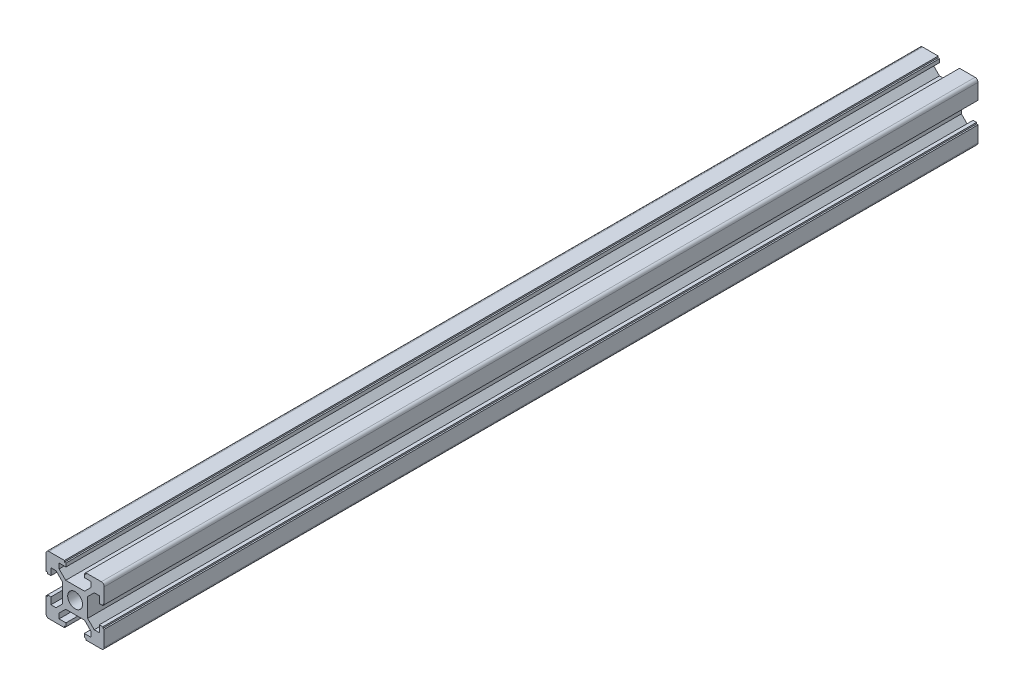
from build123d import *

# Parameters (mm, degrees)
EXTRUDE_1_DEPTH = 150


with BuildPart() as part:
    # Sketch 1 → Extrude 1 (new, symmetric)
    with BuildSketch(Plane.XY):
        with BuildLine():
            Line((-9, -10), (-3.65, -10))
            Line((-3.65, -10), (-3.65, -9.5))
            Line((-3.65, -9.5), (-3.15, -9.5))
            Line((-3.15, -9.5), (-3.15, -8.3))
            Line((-3.15, -8.3), (-5.5, -8.3))
            Line((-5.5, -8.3), (-5.5, -6.560660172))
            Line((-5.5, -6.560660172), (-3.239339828, -4.3))
            Line((-3.239339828, -4.3), (0, -4.3))
            Line((0, -4.3), (3.239339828, -4.3))
            Line((3.239339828, -4.3), (5.5, -6.560660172))
            Line((5.5, -6.560660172), (5.5, -8.3))
            Line((5.5, -8.3), (3.15, -8.3))
            Line((3.15, -8.3), (3.15, -9.5))
            Line((3.15, -9.5), (3.65, -9.5))
            Line((3.65, -9.5), (3.65, -10))
            Line((3.65, -10), (9, -10))
            ThreePointArc((9, -10), (9.707106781, -9.707106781), (10, -9))
            Line((10, -9), (10, -3.65))
            Line((10, -3.65), (9.5, -3.65))
            Line((9.5, -3.65), (9.5, -3.15))
            Line((9.5, -3.15), (8.3, -3.15))
            Line((8.3, -3.15), (8.3, -5.5))
            Line((8.3, -5.5), (6.560660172, -5.5))
            Line((6.560660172, -5.5), (4.3, -3.239339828))
            Line((4.3, -3.239339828), (4.3, 0))
            Line((4.3, 0), (4.3, 3.239339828))
            Line((4.3, 3.239339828), (6.560660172, 5.5))
            Line((6.560660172, 5.5), (8.3, 5.5))
            Line((8.3, 5.5), (8.3, 3.15))
            Line((8.3, 3.15), (9.5, 3.15))
            Line((9.5, 3.15), (9.5, 3.65))
            Line((9.5, 3.65), (10, 3.65))
            Line((10, 3.65), (10, 9))
            ThreePointArc((10, 9), (9.707106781, 9.707106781), (9, 10))
            Line((9, 10), (3.65, 10))
            Line((3.65, 10), (3.65, 9.5))
            Line((3.65, 9.5), (3.15, 9.5))
            Line((3.15, 9.5), (3.15, 8.3))
            Line((3.15, 8.3), (5.5, 8.3))
            Line((5.5, 8.3), (5.5, 6.560660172))
            Line((5.5, 6.560660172), (3.239339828, 4.3))
            Line((3.239339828, 4.3), (0, 4.3))
            Line((0, 4.3), (-3.239339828, 4.3))
            Line((-3.239339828, 4.3), (-5.5, 6.560660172))
            Line((-5.5, 6.560660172), (-5.5, 8.3))
            Line((-5.5, 8.3), (-3.15, 8.3))
            Line((-3.15, 8.3), (-3.15, 9.5))
            Line((-3.15, 9.5), (-3.65, 9.5))
            Line((-3.65, 9.5), (-3.65, 10))
            Line((-3.65, 10), (-9, 10))
            ThreePointArc((-9, 10), (-9.707106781, 9.707106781), (-10, 9))
            Line((-10, 9), (-10, 3.65))
            Line((-10, 3.65), (-9.5, 3.65))
            Line((-9.5, 3.65), (-9.5, 3.15))
            Line((-9.5, 3.15), (-8.3, 3.15))
            Line((-8.3, 3.15), (-8.3, 5.5))
            Line((-8.3, 5.5), (-6.560660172, 5.5))
            Line((-6.560660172, 5.5), (-4.3, 3.239339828))
            Line((-4.3, 3.239339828), (-4.3, 0))
            Line((-4.3, 0), (-4.3, -3.239339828))
            Line((-4.3, -3.239339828), (-6.560660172, -5.5))
            Line((-6.560660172, -5.5), (-8.3, -5.5))
            Line((-8.3, -5.5), (-8.3, -3.15))
            Line((-8.3, -3.15), (-9.5, -3.15))
            Line((-9.5, -3.15), (-9.5, -3.65))
            Line((-9.5, -3.65), (-10, -3.65))
            Line((-10, -3.65), (-10, -9))
            ThreePointArc((-10, -9), (-9.707106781, -9.707106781), (-9, -10))
        make_face()
        with BuildLine():
            ThreePointArc((-1.803122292, -1.803122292), (-0.975842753, -2.355892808), (0, -2.55))
            ThreePointArc((0, -2.55), (0.975842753, -2.355892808), (1.803122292, -1.803122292))
            ThreePointArc((1.803122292, -1.803122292), (2.355892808, -0.975842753), (2.55, 0))
            ThreePointArc((2.55, 0), (2.355892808, 0.975842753), (1.803122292, 1.803122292))
            ThreePointArc((1.803122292, 1.803122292), (0.975842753, 2.355892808), (0, 2.55))
            ThreePointArc((0, 2.55), (-0.975842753, 2.355892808), (-1.803122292, 1.803122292))
            ThreePointArc((-1.803122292, 1.803122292), (-2.355892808, 0.975842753), (-2.55, 0))
            ThreePointArc((-2.55, 0), (-2.355892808, -0.975842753), (-1.803122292, -1.803122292))
        make_face(mode=Mode.SUBTRACT)
    extrude(amount=EXTRUDE_1_DEPTH, both=True)


solid = part.part
